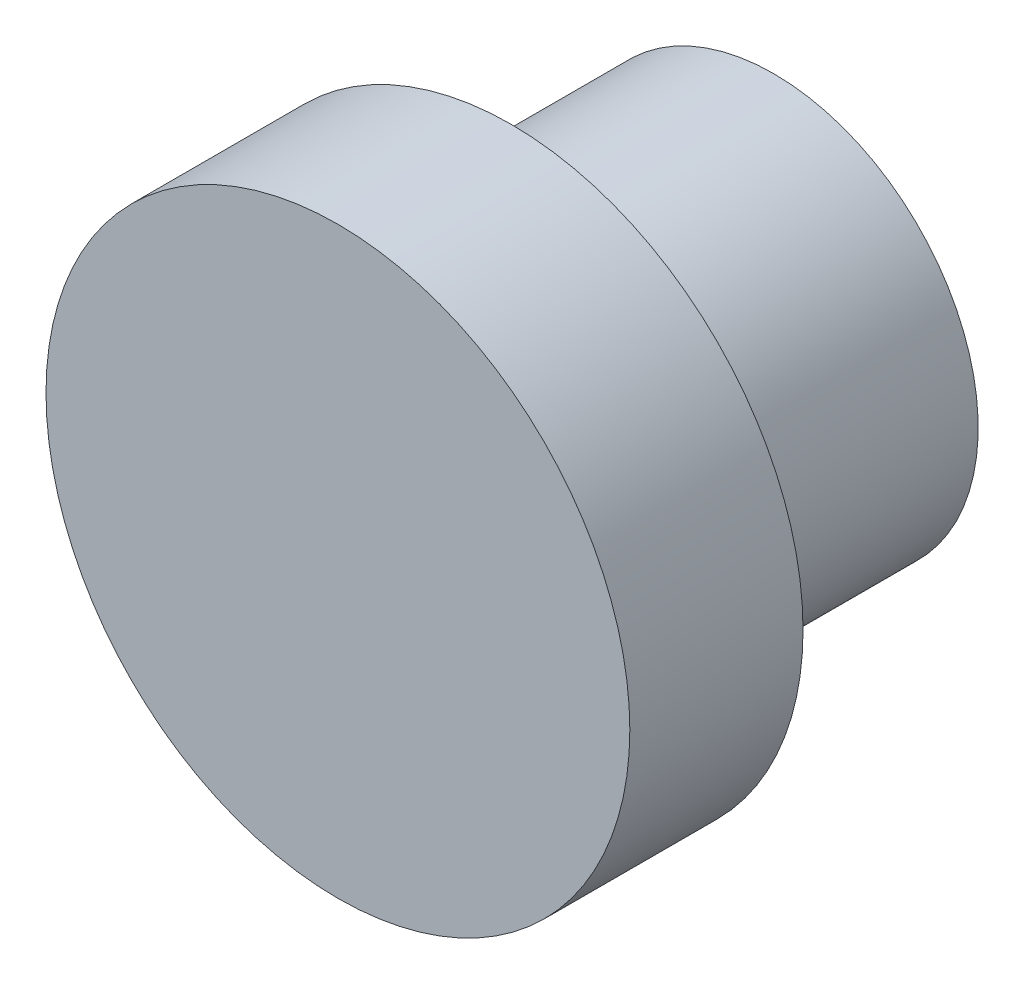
ISO-10303-21;
HEADER;
FILE_DESCRIPTION(('STEP AP214'),'2;1');
FILE_NAME('part.step','',(''),(''),'','','');
FILE_SCHEMA(('AUTOMOTIVE_DESIGN { 1 0 10303 214 1 1 1 1 }'));
ENDSEC;
DATA;
#1=APPLICATION_CONTEXT('core data for automotive mechanical design processes');
#2=APPLICATION_PROTOCOL_DEFINITION('international standard','automotive_design',2000,#1);
#3=PRODUCT_CONTEXT('',#1,'mechanical');
#4=PRODUCT('Part','Part','',(#3));
#5=PRODUCT_RELATED_PRODUCT_CATEGORY('part','',(#4));
#6=PRODUCT_DEFINITION_FORMATION('','',#4);
#7=PRODUCT_DEFINITION_CONTEXT('part definition',#1,'design');
#8=PRODUCT_DEFINITION('design','',#6,#7);
#9=PRODUCT_DEFINITION_SHAPE('','',#8);
#10=(LENGTH_UNIT() NAMED_UNIT(*) SI_UNIT(.MILLI.,.METRE.));
#11=(NAMED_UNIT(*) PLANE_ANGLE_UNIT() SI_UNIT($,.RADIAN.));
#12=(NAMED_UNIT(*) SI_UNIT($,.STERADIAN.) SOLID_ANGLE_UNIT());
#13=UNCERTAINTY_MEASURE_WITH_UNIT(LENGTH_MEASURE(1.E-05),#10,'distance_accuracy_value','');
#14=(GEOMETRIC_REPRESENTATION_CONTEXT(3) GLOBAL_UNCERTAINTY_ASSIGNED_CONTEXT((#13)) GLOBAL_UNIT_ASSIGNED_CONTEXT((#10,
#11,#12)) REPRESENTATION_CONTEXT('',''));
#15=CARTESIAN_POINT('',(0.,0.,0.));
#16=DIRECTION('',(0.,0.,1.));
#17=DIRECTION('',(1.,0.,0.));
#18=AXIS2_PLACEMENT_3D('',#15,#16,#17);
#19=CARTESIAN_POINT('',(0.,0.,-10.8832062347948));
#20=DIRECTION('',(0.,0.,1.));
#21=DIRECTION('',(0.,1.,0.));
#22=AXIS2_PLACEMENT_3D('',#19,#20,#21);
#23=CYLINDRICAL_SURFACE('',#22,10.5);
#24=CARTESIAN_POINT('',(0.,0.,-33.2832062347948));
#25=DIRECTION('',(0.,0.,-1.));
#26=DIRECTION('',(0.,-1.,0.));
#27=AXIS2_PLACEMENT_3D('',#24,#25,#26);
#28=CIRCLE('',#27,10.5);
#29=CARTESIAN_POINT('',(0.,-10.5,-33.2832062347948));
#30=VERTEX_POINT('',#29);
#31=EDGE_CURVE('E9',#30,#30,#28,.F.);
#32=ORIENTED_EDGE('',*,*,#31,.T.);
#33=EDGE_LOOP('',(#32));
#34=FACE_BOUND('',#33,.T.);
#35=CARTESIAN_POINT('',(0.,0.,-19.7832062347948));
#36=DIRECTION('',(0.,0.,-1.));
#37=DIRECTION('',(0.,-1.,0.));
#38=AXIS2_PLACEMENT_3D('',#35,#36,#37);
#39=CIRCLE('',#38,10.5);
#40=CARTESIAN_POINT('',(0.,-10.5,-19.7832062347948));
#41=VERTEX_POINT('',#40);
#42=EDGE_CURVE('E36',#41,#41,#39,.T.);
#43=ORIENTED_EDGE('',*,*,#42,.T.);
#44=EDGE_LOOP('',(#43));
#45=FACE_BOUND('',#44,.T.);
#46=ADVANCED_FACE('F13',(#34,#45),#23,.T.);
#47=CARTESIAN_POINT('',(0.,0.,-10.8832062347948));
#48=DIRECTION('',(0.,0.,1.));
#49=DIRECTION('',(0.,1.,0.));
#50=AXIS2_PLACEMENT_3D('',#47,#48,#49);
#51=CYLINDRICAL_SURFACE('',#50,7.75);
#52=CARTESIAN_POINT('',(0.,0.,-31.7832062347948));
#53=DIRECTION('',(0.,0.,1.));
#54=DIRECTION('',(0.,1.,0.));
#55=AXIS2_PLACEMENT_3D('',#52,#53,#54);
#56=CIRCLE('',#55,7.75);
#57=CARTESIAN_POINT('',(0.,7.75,-31.7832062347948));
#58=VERTEX_POINT('',#57);
#59=EDGE_CURVE('E24',#58,#58,#56,.T.);
#60=ORIENTED_EDGE('',*,*,#59,.T.);
#61=EDGE_LOOP('',(#60));
#62=FACE_BOUND('',#61,.T.);
#63=CARTESIAN_POINT('',(0.,0.,-33.2832062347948));
#64=DIRECTION('',(0.,0.,1.));
#65=DIRECTION('',(0.,1.,0.));
#66=AXIS2_PLACEMENT_3D('',#63,#64,#65);
#67=CIRCLE('',#66,7.75);
#68=CARTESIAN_POINT('',(0.,7.75,-33.2832062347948));
#69=VERTEX_POINT('',#68);
#70=EDGE_CURVE('E20',#69,#69,#67,.T.);
#71=ORIENTED_EDGE('',*,*,#70,.F.);
#72=EDGE_LOOP('',(#71));
#73=FACE_BOUND('',#72,.T.);
#74=ADVANCED_FACE('F15',(#62,#73),#51,.F.);
#75=CARTESIAN_POINT('',(-7.75,0.,-10.8832062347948));
#76=DIRECTION('',(0.,0.,1.));
#77=DIRECTION('',(0.,1.,0.));
#78=AXIS2_PLACEMENT_3D('',#75,#76,#77);
#79=PLANE('',#78);
#80=CARTESIAN_POINT('',(0.,0.,-10.8832062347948));
#81=DIRECTION('',(0.,0.,-1.));
#82=DIRECTION('',(0.,-1.,0.));
#83=AXIS2_PLACEMENT_3D('',#80,#81,#82);
#84=CIRCLE('',#83,15.);
#85=CARTESIAN_POINT('',(0.,-15.,-10.8832062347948));
#86=VERTEX_POINT('',#85);
#87=EDGE_CURVE('E42',#86,#86,#84,.T.);
#88=ORIENTED_EDGE('',*,*,#87,.F.);
#89=EDGE_LOOP('',(#88));
#90=FACE_BOUND('',#89,.T.);
#91=ADVANCED_FACE('F70',(#90),#79,.T.);
#92=CARTESIAN_POINT('',(-10.5,0.,-33.2832062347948));
#93=DIRECTION('',(0.,0.,-1.));
#94=DIRECTION('',(0.,-1.,0.));
#95=AXIS2_PLACEMENT_3D('',#92,#93,#94);
#96=PLANE('',#95);
#97=ORIENTED_EDGE('',*,*,#31,.F.);
#98=EDGE_LOOP('',(#97));
#99=FACE_BOUND('',#98,.T.);
#100=ORIENTED_EDGE('',*,*,#70,.T.);
#101=EDGE_LOOP('',(#100));
#102=FACE_BOUND('',#101,.T.);
#103=ADVANCED_FACE('F74',(#99,#102),#96,.T.);
#104=CARTESIAN_POINT('',(0.,0.,-28.0832062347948));
#105=DIRECTION('',(0.,0.,1.));
#106=DIRECTION('',(0.,1.,0.));
#107=AXIS2_PLACEMENT_3D('',#104,#105,#106);
#108=CONICAL_SURFACE('',#107,8.40240982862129,0.174532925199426);
#109=ORIENTED_EDGE('',*,*,#59,.F.);
#110=EDGE_LOOP('',(#109));
#111=FACE_BOUND('',#110,.T.);
#112=CARTESIAN_POINT('',(0.,0.,-28.0832062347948));
#113=DIRECTION('',(0.,0.,1.));
#114=DIRECTION('',(0.,1.,0.));
#115=AXIS2_PLACEMENT_3D('',#112,#113,#114);
#116=CIRCLE('',#115,8.40240982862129);
#117=CARTESIAN_POINT('',(0.,8.40240982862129,-28.0832062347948));
#118=VERTEX_POINT('',#117);
#119=EDGE_CURVE('E28',#118,#118,#116,.T.);
#120=ORIENTED_EDGE('',*,*,#119,.T.);
#121=EDGE_LOOP('',(#120));
#122=FACE_BOUND('',#121,.T.);
#123=ADVANCED_FACE('F82',(#111,#122),#108,.F.);
#124=CARTESIAN_POINT('',(-8.40240982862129,0.,-28.0832062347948));
#125=DIRECTION('',(0.,0.,-1.));
#126=DIRECTION('',(0.,-1.,0.));
#127=AXIS2_PLACEMENT_3D('',#124,#125,#126);
#128=PLANE('',#127);
#129=ORIENTED_EDGE('',*,*,#119,.F.);
#130=EDGE_LOOP('',(#129));
#131=FACE_BOUND('',#130,.T.);
#132=CARTESIAN_POINT('',(0.,0.,-28.0832062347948));
#133=DIRECTION('',(0.,0.,1.));
#134=DIRECTION('',(0.,1.,0.));
#135=AXIS2_PLACEMENT_3D('',#132,#133,#134);
#136=CIRCLE('',#135,9.5);
#137=CARTESIAN_POINT('',(0.,9.5,-28.0832062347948));
#138=VERTEX_POINT('',#137);
#139=EDGE_CURVE('E33',#138,#138,#136,.T.);
#140=ORIENTED_EDGE('',*,*,#139,.T.);
#141=EDGE_LOOP('',(#140));
#142=FACE_BOUND('',#141,.T.);
#143=ADVANCED_FACE('F90',(#131,#142),#128,.F.);
#144=CARTESIAN_POINT('',(0.,0.,-10.8832062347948));
#145=DIRECTION('',(0.,0.,1.));
#146=DIRECTION('',(0.,1.,0.));
#147=AXIS2_PLACEMENT_3D('',#144,#145,#146);
#148=CYLINDRICAL_SURFACE('',#147,9.5);
#149=CARTESIAN_POINT('',(0.,0.,-19.4832062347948));
#150=DIRECTION('',(0.,0.,1.));
#151=DIRECTION('',(0.,1.,0.));
#152=AXIS2_PLACEMENT_3D('',#149,#150,#151);
#153=CIRCLE('',#152,9.5);
#154=CARTESIAN_POINT('',(0.,9.5,-19.4832062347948));
#155=VERTEX_POINT('',#154);
#156=EDGE_CURVE('E45',#155,#155,#153,.T.);
#157=ORIENTED_EDGE('',*,*,#156,.T.);
#158=EDGE_LOOP('',(#157));
#159=FACE_BOUND('',#158,.T.);
#160=ORIENTED_EDGE('',*,*,#139,.F.);
#161=EDGE_LOOP('',(#160));
#162=FACE_BOUND('',#161,.T.);
#163=ADVANCED_FACE('F49',(#159,#162),#148,.F.);
#164=CARTESIAN_POINT('',(-10.5,0.,-19.7832062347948));
#165=DIRECTION('',(0.,0.,1.));
#166=DIRECTION('',(0.,1.,0.));
#167=AXIS2_PLACEMENT_3D('',#164,#165,#166);
#168=PLANE('',#167);
#169=ORIENTED_EDGE('',*,*,#42,.F.);
#170=EDGE_LOOP('',(#169));
#171=FACE_BOUND('',#170,.T.);
#172=CARTESIAN_POINT('',(0.,0.,-19.7832062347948));
#173=DIRECTION('',(0.,0.,-1.));
#174=DIRECTION('',(0.,-1.,0.));
#175=AXIS2_PLACEMENT_3D('',#172,#173,#174);
#176=CIRCLE('',#175,15.);
#177=CARTESIAN_POINT('',(0.,-15.,-19.7832062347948));
#178=VERTEX_POINT('',#177);
#179=EDGE_CURVE('E39',#178,#178,#176,.T.);
#180=ORIENTED_EDGE('',*,*,#179,.T.);
#181=EDGE_LOOP('',(#180));
#182=FACE_BOUND('',#181,.T.);
#183=ADVANCED_FACE('F61',(#171,#182),#168,.F.);
#184=CARTESIAN_POINT('',(0.,0.,-10.8832062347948));
#185=DIRECTION('',(0.,0.,-1.));
#186=DIRECTION('',(0.,-1.,0.));
#187=AXIS2_PLACEMENT_3D('',#184,#185,#186);
#188=CYLINDRICAL_SURFACE('',#187,15.);
#189=ORIENTED_EDGE('',*,*,#179,.F.);
#190=EDGE_LOOP('',(#189));
#191=FACE_BOUND('',#190,.T.);
#192=ORIENTED_EDGE('',*,*,#87,.T.);
#193=EDGE_LOOP('',(#192));
#194=FACE_BOUND('',#193,.T.);
#195=ADVANCED_FACE('F54',(#191,#194),#188,.T.);
#196=CARTESIAN_POINT('',(-9.5,0.,-19.4832062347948));
#197=DIRECTION('',(0.,0.,-1.));
#198=DIRECTION('',(0.,-1.,0.));
#199=AXIS2_PLACEMENT_3D('',#196,#197,#198);
#200=PLANE('',#199);
#201=ORIENTED_EDGE('',*,*,#156,.F.);
#202=EDGE_LOOP('',(#201));
#203=FACE_BOUND('',#202,.T.);
#204=ADVANCED_FACE('F52',(#203),#200,.T.);
#205=CLOSED_SHELL('',(#46,#74,#91,#103,#123,#143,#163,#183,#195,#204));
#206=MANIFOLD_SOLID_BREP('B1',#205);
#207=ADVANCED_BREP_SHAPE_REPRESENTATION('',(#18,#206),#14);
#208=SHAPE_DEFINITION_REPRESENTATION(#9,#207);
ENDSEC;
END-ISO-10303-21;
